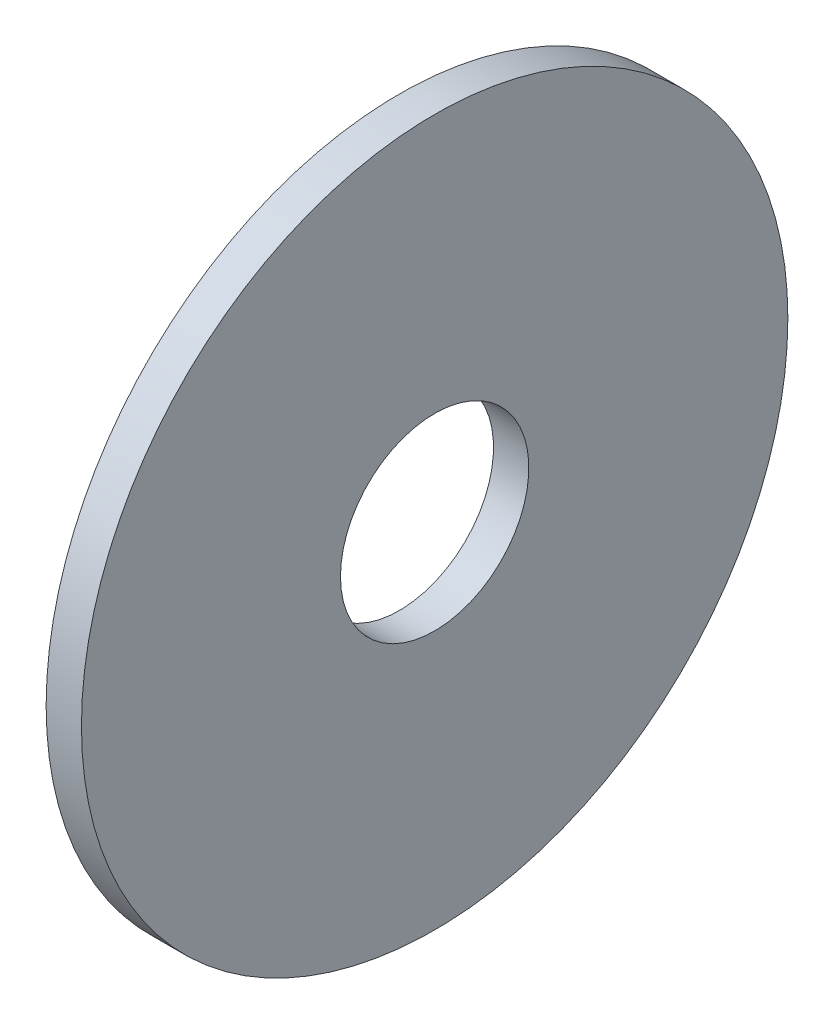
from build123d import *

# Parameters (mm, degrees)
ESQUISSE1_W = 1.2
ESQUISSE1_H = 8.8


with BuildPart() as part:
    # Esquisse1 → Base-R_volution (revolve)
    with BuildSketch(Plane(origin=(0, 0, 0), x_dir=(1, 0, 0), z_dir=(0, 1, 0)), mode=Mode.PRIVATE) as base_r_volution_sk:
        with Locations((0.6, 7.6)):
            Rectangle(ESQUISSE1_W, ESQUISSE1_H)
    revolve(base_r_volution_sk.sketch.rotate(Axis((0, 0, 0), (1, 0, 0)), 180), axis=Axis((0, 0, 0), (1, 0, 0)))


solid = part.part
